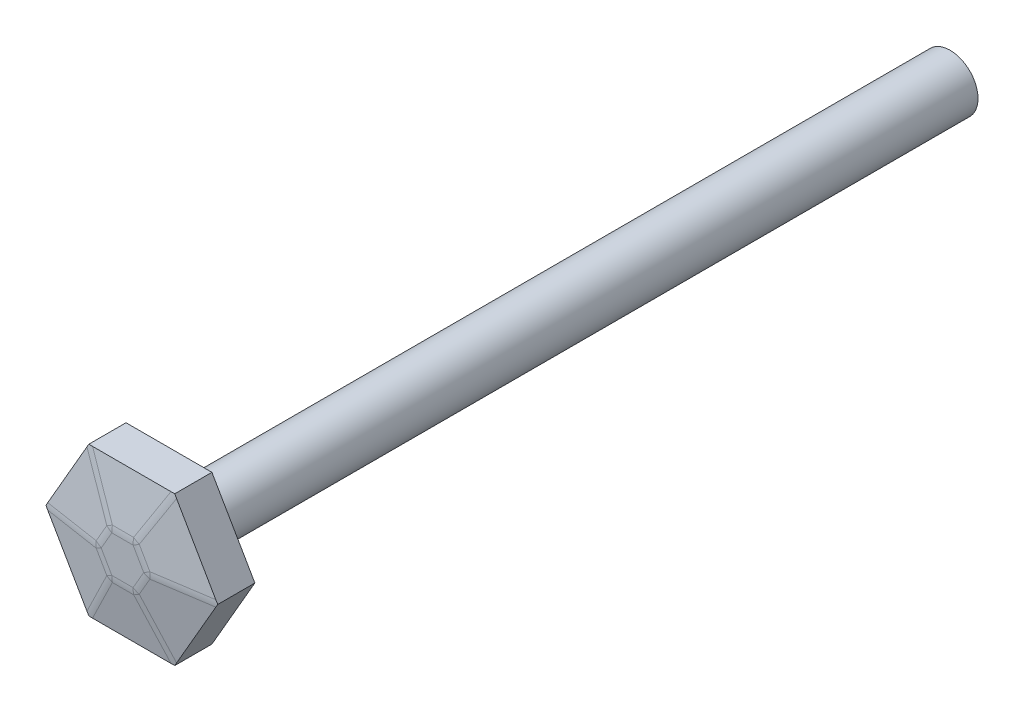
from build123d import *
from OCP.BRepFilletAPI import BRepFilletAPI_MakeChamfer

# Parameters (mm, degrees)
SKETCH1_R           = 1.905
BOSS_EXTRUDE1_DEPTH = 53.34
BOSS_EXTRUDE2_DEPTH = 3.175
CHAMFER1_SIZE       = 0.635
CHAMFER1_SIZE2      = 3.601263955
FILLET1_R           = 2.54


with BuildPart() as part:
    # Sketch1 → Boss-Extrude1 (new body)
    with BuildSketch(Plane.XY):
        Circle(SKETCH1_R)
    extrude(amount=BOSS_EXTRUDE1_DEPTH)

    # Sketch2 → Boss-Extrude2 (add)
    with BuildSketch(Plane.XY.offset(53.34)):
        Polygon((5.865878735, 0), (2.932939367, 5.08), (-2.932939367, 5.08), (-5.865878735, 0), (-2.932939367, -5.08), (2.932939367, -5.08), align=None)
    extrude(amount=BOSS_EXTRUDE2_DEPTH)

    # Chamfer1: one chamfer whose edges measure the first distance from different faces: ONE call of the kernel's chamfer builder (chamfer() names one face for all edges)
    chamfer1_edges_1 = [part.edges().sort_by_distance(p)[0] for p in [
        (4.399409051, -2.54, 56.515),
    ]]
    chamfer1_side_1 = [part.faces().sort_by_distance(p)[0] for p in [
        (4.399409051, -2.54, 54.9275),
    ]]
    chamfer1_edges_2 = [part.edges().sort_by_distance(p)[0] for p in [
        (4.399409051, 2.54, 56.515),
    ]]
    chamfer1_side_2 = [part.faces().sort_by_distance(p)[0] for p in [
        (4.399409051, 2.54, 54.9275),
    ]]
    chamfer1_edges_3 = [part.edges().sort_by_distance(p)[0] for p in [
        (0, 5.08, 56.515),
    ]]
    chamfer1_side_3 = [part.faces().sort_by_distance(p)[0] for p in [
        (0, 5.08, 54.9275),
    ]]
    chamfer1_edges_4 = [part.edges().sort_by_distance(p)[0] for p in [
        (-4.399409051, 2.54, 56.515),
    ]]
    chamfer1_side_4 = [part.faces().sort_by_distance(p)[0] for p in [
        (-4.399409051, 2.54, 54.9275),
    ]]
    chamfer1_edges_5 = [part.edges().sort_by_distance(p)[0] for p in [
        (-4.399409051, -2.54, 56.515),
    ]]
    chamfer1_side_5 = [part.faces().sort_by_distance(p)[0] for p in [
        (-4.399409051, -2.54, 54.9275),
    ]]
    chamfer1_edges_6 = [part.edges().sort_by_distance(p)[0] for p in [
        (0, -5.08, 56.515),
    ]]
    chamfer1_side_6 = [part.faces().sort_by_distance(p)[0] for p in [
        (0, -5.08, 54.9275),
    ]]
    chamfer1 = BRepFilletAPI_MakeChamfer(part.part.solid().wrapped)
    for e in chamfer1_edges_1:
        chamfer1.Add(CHAMFER1_SIZE, CHAMFER1_SIZE2, e.wrapped, chamfer1_side_1[0].wrapped)  # the first distance lies on this face
    for e in chamfer1_edges_2:
        chamfer1.Add(CHAMFER1_SIZE, CHAMFER1_SIZE2, e.wrapped, chamfer1_side_2[0].wrapped)  # the first distance lies on this face
    for e in chamfer1_edges_3:
        chamfer1.Add(CHAMFER1_SIZE, CHAMFER1_SIZE2, e.wrapped, chamfer1_side_3[0].wrapped)  # the first distance lies on this face
    for e in chamfer1_edges_4:
        chamfer1.Add(CHAMFER1_SIZE, CHAMFER1_SIZE2, e.wrapped, chamfer1_side_4[0].wrapped)  # the first distance lies on this face
    for e in chamfer1_edges_5:
        chamfer1.Add(CHAMFER1_SIZE, CHAMFER1_SIZE2, e.wrapped, chamfer1_side_5[0].wrapped)  # the first distance lies on this face
    for e in chamfer1_edges_6:
        chamfer1.Add(CHAMFER1_SIZE, CHAMFER1_SIZE2, e.wrapped, chamfer1_side_6[0].wrapped)  # the first distance lies on this face
    add(Compound.cast(chamfer1.Shape()), mode=Mode.REPLACE)

    # Fillet1
    fillet1_edges = [part.edges().sort_by_distance(p)[0] for p in [
        (1.28062298, 0.739368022, 56.515),
        (0, 1.478736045, 56.515),
        (-1.28062298, 0.739368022, 56.515),
        (-1.28062298, -0.739368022, 56.515),
        (0, -1.478736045, 56.515),
        (1.28062298, -0.739368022, 56.515),
        (-3.786688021, 0, 56.1975),
        (-1.89334401, 3.279368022, 56.1975),
        (-1.89334401, -3.279368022, 56.1975),
        (1.89334401, 3.279368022, 56.1975),
        (1.89334401, -3.279368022, 56.1975),
        (3.786688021, 0, 56.1975),
    ]]
    fillet(fillet1_edges, radius=FILLET1_R)


solid = part.part
